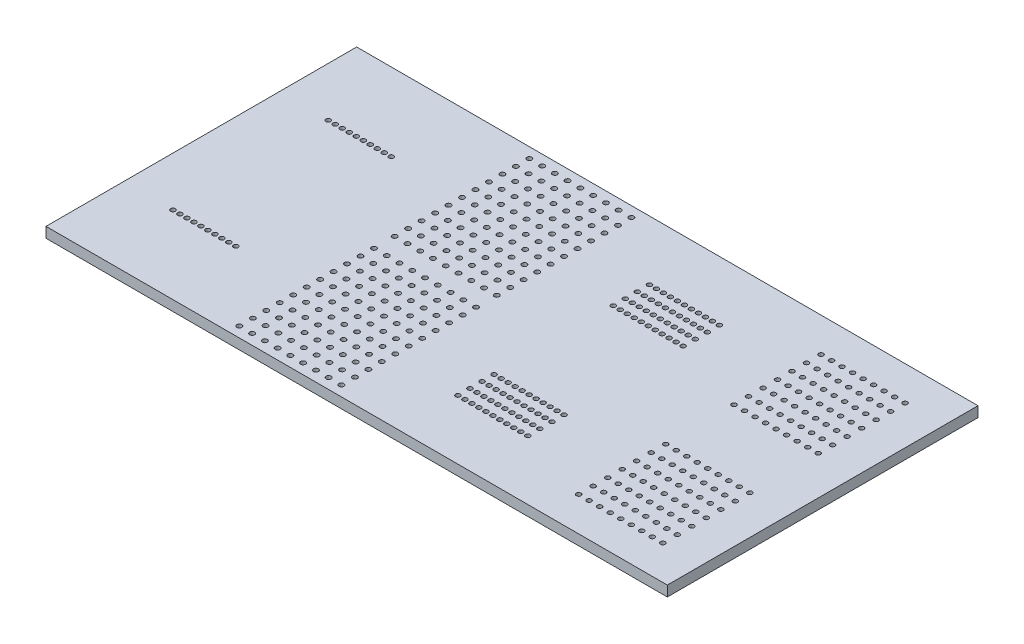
from build123d import *

# Parameters (mm, degrees)
ESQUISSE2_W                     = 120
ESQUISSE2_H                     = 30
BOSS_EXTRU_1_DEPTH              = 2
ENL_V_MAT_EXTRU_3_REACH         = 63.879
ESQUISSE8_R                     = 0.45
R_P_TITION_LIN_AIRE4_COUNT      = 10
R_P_TITION_LIN_AIRE4_PITCH      = 1.35
ENL_V_MAT_EXTRU_4_REACH         = 63.879
ESQUISSE10_R                    = 0.475
R_P_TITION_LIN_AIRE5_COUNT      = 9
R_P_TITION_LIN_AIRE5_PITCH      = 2.464
R_P_TITION_LIN_AIRE5_COUNT_DIR2 = 11
R_P_TITION_LIN_AIRE5_PITCH_DIR2 = 2.6
ENL_V_MAT_EXTRU_5_REACH         = 63.879
ESQUISSE12_R                    = 0.45
R_P_TITION_LIN_AIRE6_COUNT      = 11
R_P_TITION_LIN_AIRE6_PITCH      = 1.35
R_P_TITION_LIN_AIRE6_COUNT_DIR2 = 4
R_P_TITION_LIN_AIRE6_PITCH_DIR2 = 2.333
ENL_V_MAT_EXTRU_6_REACH         = 63.879
ESQUISSE14_R                    = 0.45
R_P_TITION_LIN_AIRE7_COUNT      = 9
R_P_TITION_LIN_AIRE7_PITCH      = 2.03
R_P_TITION_LIN_AIRE7_COUNT_DIR2 = 7
R_P_TITION_LIN_AIRE7_PITCH_DIR2 = 2.8


with BuildPart() as part:
    # Esquisse2 → Boss.-Extru.1 (new body)
    with BuildSketch(Plane(origin=(0, 0, 0), x_dir=(1, 0, 0), z_dir=(0, 1, 0))):
        Rectangle(ESQUISSE2_W, ESQUISSE2_H)
    extrude(amount=BOSS_EXTRU_1_DEPTH)

    # Esquisse8 → Enl_v. mat.-Extru.3 (cut, up to next)
    with BuildSketch(Plane(origin=(0, 2, 0), x_dir=(1, 0, 0), z_dir=(0, 1, 0)), mode=Mode.PRIVATE) as enl_v_mat_extru_3_sk1:
        with Locations(Location((-50.475, 0, 0), (0, 0, 270))):
            Circle(ESQUISSE8_R)
    enl_v_mat_extru_3_tool1 = extrude(enl_v_mat_extru_3_sk1.sketch, amount=-ENL_V_MAT_EXTRU_3_REACH, mode=Mode.PRIVATE) & part.part
    enl_v_mat_extru_3 = enl_v_mat_extru_3_tool1.solids().sort_by_distance((-50.475, 2, 0))[0]
    add(enl_v_mat_extru_3, mode=Mode.SUBTRACT)

    # R_p_tition lin_aire4: Enl_v. mat.-Extru.3 ×10
    with Locations(*[(i * R_P_TITION_LIN_AIRE4_PITCH, 0, 0) for i in range(1, R_P_TITION_LIN_AIRE4_COUNT)]):
        add(enl_v_mat_extru_3, mode=Mode.SUBTRACT)

    # Esquisse10 → Enl_v. mat.-Extru.4 (cut, up to next)
    with BuildSketch(Plane(origin=(0, 2, 0), x_dir=(1, 0, 0), z_dir=(0, 1, 0)), mode=Mode.PRIVATE) as enl_v_mat_extru_4_sk1:
        with Locations(Location((-24.656, 13, 0), (0, 0, 270))):
            Circle(ESQUISSE10_R)
    enl_v_mat_extru_4_tool1 = extrude(enl_v_mat_extru_4_sk1.sketch, amount=-ENL_V_MAT_EXTRU_4_REACH, mode=Mode.PRIVATE) & part.part
    enl_v_mat_extru_4 = enl_v_mat_extru_4_tool1.solids().sort_by_distance((-24.656, 2, -13))[0]
    add(enl_v_mat_extru_4, mode=Mode.SUBTRACT)

    # R_p_tition lin_aire5: Enl_v. mat.-Extru.4 9 × 11
    with Locations(*[(i * R_P_TITION_LIN_AIRE5_PITCH, 0, j * R_P_TITION_LIN_AIRE5_PITCH_DIR2) for i in range(R_P_TITION_LIN_AIRE5_COUNT) for j in range(R_P_TITION_LIN_AIRE5_COUNT_DIR2) if (i, j) != (0, 0)]):
        add(enl_v_mat_extru_4, mode=Mode.SUBTRACT)

    # Esquisse12 → Enl_v. mat.-Extru.5 (cut, up to next)
    with BuildSketch(Plane(origin=(0, 2, 0), x_dir=(1, 0, 0), z_dir=(0, 1, 0)), mode=Mode.PRIVATE) as enl_v_mat_extru_5_sk1:
        with Locations(Location((8.05, 3.4995, 0), (0, 0, 270))):
            Circle(ESQUISSE12_R)
    enl_v_mat_extru_5_tool1 = extrude(enl_v_mat_extru_5_sk1.sketch, amount=-ENL_V_MAT_EXTRU_5_REACH, mode=Mode.PRIVATE) & part.part
    enl_v_mat_extru_5 = enl_v_mat_extru_5_tool1.solids().sort_by_distance((8.05, 2, -3.4995))[0]
    add(enl_v_mat_extru_5, mode=Mode.SUBTRACT)

    # R_p_tition lin_aire6: Enl_v. mat.-Extru.5 11 × 4
    with Locations(*[(i * R_P_TITION_LIN_AIRE6_PITCH, 0, j * R_P_TITION_LIN_AIRE6_PITCH_DIR2) for i in range(R_P_TITION_LIN_AIRE6_COUNT) for j in range(R_P_TITION_LIN_AIRE6_COUNT_DIR2) if (i, j) != (0, 0)]):
        add(enl_v_mat_extru_5, mode=Mode.SUBTRACT)

    # Esquisse14 → Enl_v. mat.-Extru.6 (cut, up to next)
    with BuildSketch(Plane(origin=(0, 2, 0), x_dir=(1, 0, 0), z_dir=(0, 1, 0)), mode=Mode.PRIVATE) as enl_v_mat_extru_6_sk1:
        with Locations(Location((36.28, 8.4, 0), (0, 0, 270))):
            Circle(ESQUISSE14_R)
    enl_v_mat_extru_6_tool1 = extrude(enl_v_mat_extru_6_sk1.sketch, amount=-ENL_V_MAT_EXTRU_6_REACH, mode=Mode.PRIVATE) & part.part
    enl_v_mat_extru_6 = enl_v_mat_extru_6_tool1.solids().sort_by_distance((36.28, 2, -8.4))[0]
    add(enl_v_mat_extru_6, mode=Mode.SUBTRACT)

    # R_p_tition lin_aire7: Enl_v. mat.-Extru.6 9 × 7
    with Locations(*[(i * R_P_TITION_LIN_AIRE7_PITCH, 0, j * R_P_TITION_LIN_AIRE7_PITCH_DIR2) for i in range(R_P_TITION_LIN_AIRE7_COUNT) for j in range(R_P_TITION_LIN_AIRE7_COUNT_DIR2) if (i, j) != (0, 0)]):
        add(enl_v_mat_extru_6, mode=Mode.SUBTRACT)

    # Sym_trie1: part across plane


with BuildPart() as part_1:
    add(part.part)
    add(part.part.mirror(Plane(origin=(-60, 2, 15), x_dir=(1, 0, 0), z_dir=(0, 0, -1))))


solid = part_1.part
